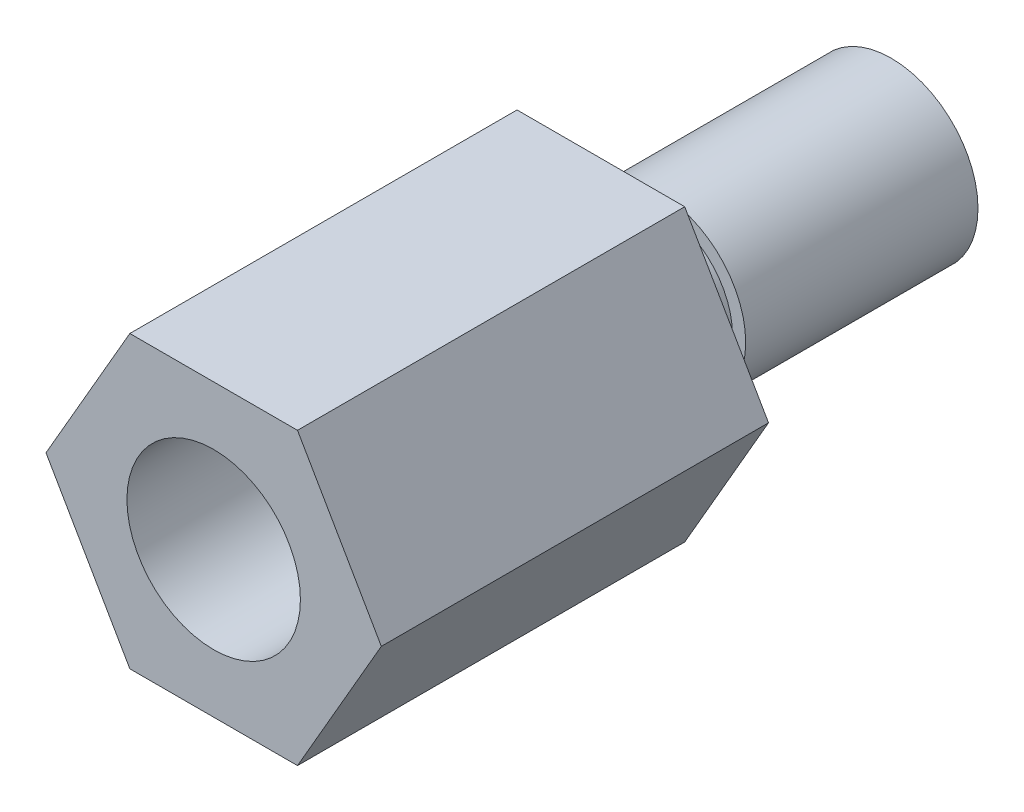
ISO-10303-21;
HEADER;
FILE_DESCRIPTION(('STEP AP214'),'2;1');
FILE_NAME('part.step','',(''),(''),'','','');
FILE_SCHEMA(('AUTOMOTIVE_DESIGN { 1 0 10303 214 1 1 1 1 }'));
ENDSEC;
DATA;
#1=APPLICATION_CONTEXT('core data for automotive mechanical design processes');
#2=APPLICATION_PROTOCOL_DEFINITION('international standard','automotive_design',2000,#1);
#3=PRODUCT_CONTEXT('',#1,'mechanical');
#4=PRODUCT('Part','Part','',(#3));
#5=PRODUCT_RELATED_PRODUCT_CATEGORY('part','',(#4));
#6=PRODUCT_DEFINITION_FORMATION('','',#4);
#7=PRODUCT_DEFINITION_CONTEXT('part definition',#1,'design');
#8=PRODUCT_DEFINITION('design','',#6,#7);
#9=PRODUCT_DEFINITION_SHAPE('','',#8);
#10=(LENGTH_UNIT() NAMED_UNIT(*) SI_UNIT(.MILLI.,.METRE.));
#11=(NAMED_UNIT(*) PLANE_ANGLE_UNIT() SI_UNIT($,.RADIAN.));
#12=(NAMED_UNIT(*) SI_UNIT($,.STERADIAN.) SOLID_ANGLE_UNIT());
#13=UNCERTAINTY_MEASURE_WITH_UNIT(LENGTH_MEASURE(1.E-05),#10,'distance_accuracy_value','');
#14=(GEOMETRIC_REPRESENTATION_CONTEXT(3) GLOBAL_UNCERTAINTY_ASSIGNED_CONTEXT((#13)) GLOBAL_UNIT_ASSIGNED_CONTEXT((#10,
#11,#12)) REPRESENTATION_CONTEXT('',''));
#15=CARTESIAN_POINT('',(0.,0.,0.));
#16=DIRECTION('',(0.,0.,1.));
#17=DIRECTION('',(1.,0.,0.));
#18=AXIS2_PLACEMENT_3D('',#15,#16,#17);
#19=CARTESIAN_POINT('',(-4.12444598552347,-2.38125000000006,0.));
#20=DIRECTION('',(0.,0.,1.));
#21=DIRECTION('',(1.,0.,0.));
#22=AXIS2_PLACEMENT_3D('',#19,#20,#21);
#23=PLANE('',#22);
#24=DIRECTION('',(-0.499999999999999,-0.866025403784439,0.));
#25=VECTOR('',#24,1.);
#26=CARTESIAN_POINT('',(-2.74963065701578,0.,0.));
#27=LINE('',#26,#25);
#28=CARTESIAN_POINT('',(-1.37481532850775,2.38124999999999,0.));
#29=VERTEX_POINT('',#28);
#30=CARTESIAN_POINT('',(-2.74963065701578,0.,0.));
#31=VERTEX_POINT('',#30);
#32=EDGE_CURVE('E83',#29,#31,#27,.T.);
#33=ORIENTED_EDGE('',*,*,#32,.F.);
#34=DIRECTION('',(-1.,0.,0.));
#35=VECTOR('',#34,1.);
#36=CARTESIAN_POINT('',(-1.37481532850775,2.38124999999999,0.));
#37=LINE('',#36,#35);
#38=CARTESIAN_POINT('',(1.37481532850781,2.38125,0.));
#39=VERTEX_POINT('',#38);
#40=EDGE_CURVE('E109',#39,#29,#37,.T.);
#41=ORIENTED_EDGE('',*,*,#40,.F.);
#42=DIRECTION('',(-0.499999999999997,0.86602540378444,0.));
#43=VECTOR('',#42,1.);
#44=CARTESIAN_POINT('',(1.37481532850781,2.38125,0.));
#45=LINE('',#44,#43);
#46=CARTESIAN_POINT('',(2.74963065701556,0.,0.));
#47=VERTEX_POINT('',#46);
#48=EDGE_CURVE('E107',#47,#39,#45,.T.);
#49=ORIENTED_EDGE('',*,*,#48,.F.);
#50=DIRECTION('',(0.499999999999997,0.86602540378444,0.));
#51=VECTOR('',#50,1.);
#52=CARTESIAN_POINT('',(2.74963065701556,0.,0.));
#53=LINE('',#52,#51);
#54=CARTESIAN_POINT('',(1.37481532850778,-2.38125000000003,0.));
#55=VERTEX_POINT('',#54);
#56=EDGE_CURVE('E105',#55,#47,#53,.T.);
#57=ORIENTED_EDGE('',*,*,#56,.F.);
#58=DIRECTION('',(1.,0.,0.));
#59=VECTOR('',#58,1.);
#60=CARTESIAN_POINT('',(1.37481532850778,-2.38125000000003,0.));
#61=LINE('',#60,#59);
#62=CARTESIAN_POINT('',(-1.37481532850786,-2.38125000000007,0.));
#63=VERTEX_POINT('',#62);
#64=EDGE_CURVE('E85',#63,#55,#61,.T.);
#65=ORIENTED_EDGE('',*,*,#64,.F.);
#66=DIRECTION('',(0.499999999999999,-0.86602540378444,0.));
#67=VECTOR('',#66,1.);
#68=CARTESIAN_POINT('',(-1.37481532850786,-2.38125000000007,0.));
#69=LINE('',#68,#67);
#70=EDGE_CURVE('E79',#31,#63,#69,.T.);
#71=ORIENTED_EDGE('',*,*,#70,.F.);
#72=EDGE_LOOP('',(#33,#41,#49,#57,#65,#71));
#73=FACE_BOUND('',#72,.T.);
#74=CARTESIAN_POINT('',(0.,0.,0.));
#75=DIRECTION('',(0.,0.,-1.));
#76=DIRECTION('',(-1.,0.,0.));
#77=AXIS2_PLACEMENT_3D('',#74,#75,#76);
#78=CIRCLE('',#77,1.2065);
#79=CARTESIAN_POINT('',(1.2065,0.,0.));
#80=VERTEX_POINT('',#79);
#81=EDGE_CURVE('E189',#80,#80,#78,.T.);
#82=ORIENTED_EDGE('',*,*,#81,.F.);
#83=EDGE_LOOP('',(#82));
#84=FACE_BOUND('',#83,.T.);
#85=ADVANCED_FACE('F26',(#73,#84),#23,.F.);
#86=CARTESIAN_POINT('',(-2.74963065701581,0.,6.35));
#87=DIRECTION('',(0.866025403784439,-0.499999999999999,0.));
#88=DIRECTION('',(0.499999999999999,0.86602540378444,0.));
#89=AXIS2_PLACEMENT_3D('',#86,#87,#88);
#90=PLANE('',#89);
#91=ORIENTED_EDGE('',*,*,#32,.T.);
#92=DIRECTION('',(0.,0.,-1.));
#93=VECTOR('',#92,1.);
#94=CARTESIAN_POINT('',(-2.74963065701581,0.,6.35));
#95=LINE('',#94,#93);
#96=CARTESIAN_POINT('',(-2.74963065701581,0.,6.35));
#97=VERTEX_POINT('',#96);
#98=EDGE_CURVE('E11',#97,#31,#95,.T.);
#99=ORIENTED_EDGE('',*,*,#98,.F.);
#100=DIRECTION('',(-0.499999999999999,-0.866025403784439,0.));
#101=VECTOR('',#100,1.);
#102=CARTESIAN_POINT('',(-2.74963065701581,0.,6.35));
#103=LINE('',#102,#101);
#104=CARTESIAN_POINT('',(-1.37481532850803,2.38125000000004,6.35));
#105=VERTEX_POINT('',#104);
#106=EDGE_CURVE('E111',#105,#97,#103,.T.);
#107=ORIENTED_EDGE('',*,*,#106,.F.);
#108=DIRECTION('',(0.,0.,-1.));
#109=VECTOR('',#108,1.);
#110=CARTESIAN_POINT('',(-1.37481532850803,2.38125000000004,6.35));
#111=LINE('',#110,#109);
#112=EDGE_CURVE('E96',#105,#29,#111,.T.);
#113=ORIENTED_EDGE('',*,*,#112,.T.);
#114=EDGE_LOOP('',(#91,#99,#107,#113));
#115=FACE_BOUND('',#114,.T.);
#116=ADVANCED_FACE('F28',(#115),#90,.F.);
#117=CARTESIAN_POINT('',(-1.37481532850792,-2.38125000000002,6.35));
#118=DIRECTION('',(0.866025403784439,0.499999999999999,0.));
#119=DIRECTION('',(-0.499999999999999,0.86602540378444,0.));
#120=AXIS2_PLACEMENT_3D('',#117,#118,#119);
#121=PLANE('',#120);
#122=ORIENTED_EDGE('',*,*,#70,.T.);
#123=DIRECTION('',(0.,0.,-1.));
#124=VECTOR('',#123,1.);
#125=CARTESIAN_POINT('',(-1.37481532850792,-2.38125000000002,6.35));
#126=LINE('',#125,#124);
#127=CARTESIAN_POINT('',(-1.37481532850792,-2.38125000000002,6.35));
#128=VERTEX_POINT('',#127);
#129=EDGE_CURVE('E34',#128,#63,#126,.T.);
#130=ORIENTED_EDGE('',*,*,#129,.F.);
#131=DIRECTION('',(0.499999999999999,-0.86602540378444,0.));
#132=VECTOR('',#131,1.);
#133=CARTESIAN_POINT('',(-1.37481532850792,-2.38125000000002,6.35));
#134=LINE('',#133,#132);
#135=EDGE_CURVE('E92',#97,#128,#134,.T.);
#136=ORIENTED_EDGE('',*,*,#135,.F.);
#137=ORIENTED_EDGE('',*,*,#98,.T.);
#138=EDGE_LOOP('',(#122,#130,#136,#137));
#139=FACE_BOUND('',#138,.T.);
#140=ADVANCED_FACE('F91',(#139),#121,.F.);
#141=CARTESIAN_POINT('',(1.37481532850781,-2.38125,6.35));
#142=DIRECTION('',(0.,1.,0.));
#143=DIRECTION('',(-1.,0.,0.));
#144=AXIS2_PLACEMENT_3D('',#141,#142,#143);
#145=PLANE('',#144);
#146=ORIENTED_EDGE('',*,*,#64,.T.);
#147=DIRECTION('',(0.,0.,-1.));
#148=VECTOR('',#147,1.);
#149=CARTESIAN_POINT('',(1.37481532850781,-2.38125,6.35));
#150=LINE('',#149,#148);
#151=CARTESIAN_POINT('',(1.37481532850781,-2.38125,6.35));
#152=VERTEX_POINT('',#151);
#153=EDGE_CURVE('E127',#152,#55,#150,.T.);
#154=ORIENTED_EDGE('',*,*,#153,.F.);
#155=DIRECTION('',(1.,0.,0.));
#156=VECTOR('',#155,1.);
#157=CARTESIAN_POINT('',(1.37481532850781,-2.38125,6.35));
#158=LINE('',#157,#156);
#159=EDGE_CURVE('E114',#128,#152,#158,.T.);
#160=ORIENTED_EDGE('',*,*,#159,.F.);
#161=ORIENTED_EDGE('',*,*,#129,.T.);
#162=EDGE_LOOP('',(#146,#154,#160,#161));
#163=FACE_BOUND('',#162,.T.);
#164=ADVANCED_FACE('F131',(#163),#145,.F.);
#165=CARTESIAN_POINT('',(2.74963065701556,0.,6.34999999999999));
#166=DIRECTION('',(-0.86602540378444,0.499999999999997,0.));
#167=DIRECTION('',(-0.499999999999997,-0.86602540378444,0.));
#168=AXIS2_PLACEMENT_3D('',#165,#166,#167);
#169=PLANE('',#168);
#170=ORIENTED_EDGE('',*,*,#56,.T.);
#171=DIRECTION('',(0.,0.,-1.));
#172=VECTOR('',#171,1.);
#173=CARTESIAN_POINT('',(2.74963065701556,0.,6.34999999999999));
#174=LINE('',#173,#172);
#175=CARTESIAN_POINT('',(2.74963065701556,0.,6.34999999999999));
#176=VERTEX_POINT('',#175);
#177=EDGE_CURVE('E124',#176,#47,#174,.T.);
#178=ORIENTED_EDGE('',*,*,#177,.F.);
#179=DIRECTION('',(0.499999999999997,0.86602540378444,0.));
#180=VECTOR('',#179,1.);
#181=CARTESIAN_POINT('',(2.74963065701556,0.,6.34999999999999));
#182=LINE('',#181,#180);
#183=EDGE_CURVE('E116',#152,#176,#182,.T.);
#184=ORIENTED_EDGE('',*,*,#183,.F.);
#185=ORIENTED_EDGE('',*,*,#153,.T.);
#186=EDGE_LOOP('',(#170,#178,#184,#185));
#187=FACE_BOUND('',#186,.T.);
#188=ADVANCED_FACE('F137',(#187),#169,.F.);
#189=CARTESIAN_POINT('',(1.37481532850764,2.38125000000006,6.35));
#190=DIRECTION('',(-0.86602540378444,-0.499999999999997,0.));
#191=DIRECTION('',(0.499999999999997,-0.86602540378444,0.));
#192=AXIS2_PLACEMENT_3D('',#189,#190,#191);
#193=PLANE('',#192);
#194=ORIENTED_EDGE('',*,*,#48,.T.);
#195=DIRECTION('',(0.,0.,-1.));
#196=VECTOR('',#195,1.);
#197=CARTESIAN_POINT('',(1.37481532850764,2.38125000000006,6.35));
#198=LINE('',#197,#196);
#199=CARTESIAN_POINT('',(1.37481532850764,2.38125000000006,6.35));
#200=VERTEX_POINT('',#199);
#201=EDGE_CURVE('E121',#200,#39,#198,.T.);
#202=ORIENTED_EDGE('',*,*,#201,.F.);
#203=DIRECTION('',(-0.499999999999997,0.86602540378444,0.));
#204=VECTOR('',#203,1.);
#205=CARTESIAN_POINT('',(1.37481532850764,2.38125000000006,6.35));
#206=LINE('',#205,#204);
#207=EDGE_CURVE('E46',#176,#200,#206,.T.);
#208=ORIENTED_EDGE('',*,*,#207,.F.);
#209=ORIENTED_EDGE('',*,*,#177,.T.);
#210=EDGE_LOOP('',(#194,#202,#208,#209));
#211=FACE_BOUND('',#210,.T.);
#212=ADVANCED_FACE('F140',(#211),#193,.F.);
#213=CARTESIAN_POINT('',(-1.37481532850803,2.38125000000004,6.35));
#214=DIRECTION('',(0.,-1.,0.));
#215=DIRECTION('',(0.,0.,-1.));
#216=AXIS2_PLACEMENT_3D('',#213,#214,#215);
#217=PLANE('',#216);
#218=ORIENTED_EDGE('',*,*,#40,.T.);
#219=ORIENTED_EDGE('',*,*,#112,.F.);
#220=DIRECTION('',(-1.,0.,0.));
#221=VECTOR('',#220,1.);
#222=CARTESIAN_POINT('',(-1.37481532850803,2.38125000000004,6.35));
#223=LINE('',#222,#221);
#224=EDGE_CURVE('E41',#200,#105,#223,.T.);
#225=ORIENTED_EDGE('',*,*,#224,.F.);
#226=ORIENTED_EDGE('',*,*,#201,.T.);
#227=EDGE_LOOP('',(#218,#219,#225,#226));
#228=FACE_BOUND('',#227,.T.);
#229=ADVANCED_FACE('F142',(#228),#217,.F.);
#230=CARTESIAN_POINT('',(-4.12444598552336,-2.38125000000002,6.35));
#231=DIRECTION('',(0.,0.,1.));
#232=DIRECTION('',(1.,0.,0.));
#233=AXIS2_PLACEMENT_3D('',#230,#231,#232);
#234=PLANE('',#233);
#235=CARTESIAN_POINT('',(-1.38777878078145E-13,0.,6.34999999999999));
#236=DIRECTION('',(0.,0.,1.));
#237=DIRECTION('',(1.,0.,0.));
#238=AXIS2_PLACEMENT_3D('',#235,#236,#237);
#239=CIRCLE('',#238,1.4224);
#240=CARTESIAN_POINT('',(1.4224,0.,6.34999999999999));
#241=VERTEX_POINT('',#240);
#242=EDGE_CURVE('E196',#241,#241,#239,.T.);
#243=ORIENTED_EDGE('',*,*,#242,.F.);
#244=EDGE_LOOP('',(#243));
#245=FACE_BOUND('',#244,.T.);
#246=ORIENTED_EDGE('',*,*,#106,.T.);
#247=ORIENTED_EDGE('',*,*,#135,.T.);
#248=ORIENTED_EDGE('',*,*,#159,.T.);
#249=ORIENTED_EDGE('',*,*,#183,.T.);
#250=ORIENTED_EDGE('',*,*,#207,.T.);
#251=ORIENTED_EDGE('',*,*,#224,.T.);
#252=EDGE_LOOP('',(#246,#247,#248,#249,#250,#251));
#253=FACE_BOUND('',#252,.T.);
#254=ADVANCED_FACE('F134',(#245,#253),#234,.T.);
#255=CARTESIAN_POINT('',(0.,0.,2.38124999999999));
#256=DIRECTION('',(0.,0.,1.));
#257=DIRECTION('',(1.,0.,0.));
#258=AXIS2_PLACEMENT_3D('',#255,#256,#257);
#259=CYLINDRICAL_SURFACE('',#258,1.4224);
#260=CARTESIAN_POINT('',(0.,0.,2.38124999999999));
#261=DIRECTION('',(0.,0.,1.));
#262=DIRECTION('',(1.,0.,0.));
#263=AXIS2_PLACEMENT_3D('',#260,#261,#262);
#264=CIRCLE('',#263,1.4224);
#265=CARTESIAN_POINT('',(1.4224,0.,2.38124999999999));
#266=VERTEX_POINT('',#265);
#267=EDGE_CURVE('E100',#266,#266,#264,.T.);
#268=CARTESIAN_POINT('',(1.4224,0.,2.38124999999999));
#269=CARTESIAN_POINT('',(1.4224,0.,2.42259114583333));
#270=CARTESIAN_POINT('',(1.4224,0.,2.46393229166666));
#271=CARTESIAN_POINT('',(1.4224,0.,2.54661458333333));
#272=CARTESIAN_POINT('',(1.4224,0.,2.58795572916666));
#273=CARTESIAN_POINT('',(1.4224,0.,2.67063802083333));
#274=CARTESIAN_POINT('',(1.4224,0.,2.71197916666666));
#275=CARTESIAN_POINT('',(1.4224,0.,2.79466145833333));
#276=CARTESIAN_POINT('',(1.4224,0.,2.83600260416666));
#277=CARTESIAN_POINT('',(1.4224,0.,2.91868489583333));
#278=CARTESIAN_POINT('',(1.4224,0.,2.96002604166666));
#279=CARTESIAN_POINT('',(1.4224,0.,3.04270833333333));
#280=CARTESIAN_POINT('',(1.4224,0.,3.08404947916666));
#281=CARTESIAN_POINT('',(1.4224,0.,3.16673177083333));
#282=CARTESIAN_POINT('',(1.4224,0.,3.20807291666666));
#283=CARTESIAN_POINT('',(1.4224,0.,3.29075520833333));
#284=CARTESIAN_POINT('',(1.4224,0.,3.33209635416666));
#285=CARTESIAN_POINT('',(1.4224,0.,3.41477864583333));
#286=CARTESIAN_POINT('',(1.4224,0.,3.45611979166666));
#287=CARTESIAN_POINT('',(1.4224,0.,3.53880208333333));
#288=CARTESIAN_POINT('',(1.4224,0.,3.58014322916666));
#289=CARTESIAN_POINT('',(1.4224,0.,3.66282552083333));
#290=CARTESIAN_POINT('',(1.4224,0.,3.70416666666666));
#291=CARTESIAN_POINT('',(1.4224,0.,3.78684895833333));
#292=CARTESIAN_POINT('',(1.4224,0.,3.82819010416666));
#293=CARTESIAN_POINT('',(1.4224,0.,3.91087239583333));
#294=CARTESIAN_POINT('',(1.4224,0.,3.95221354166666));
#295=CARTESIAN_POINT('',(1.4224,0.,4.03489583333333));
#296=CARTESIAN_POINT('',(1.4224,0.,4.07623697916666));
#297=CARTESIAN_POINT('',(1.4224,0.,4.15891927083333));
#298=CARTESIAN_POINT('',(1.4224,0.,4.20026041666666));
#299=CARTESIAN_POINT('',(1.4224,0.,4.28294270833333));
#300=CARTESIAN_POINT('',(1.4224,0.,4.32428385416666));
#301=CARTESIAN_POINT('',(1.4224,0.,4.40696614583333));
#302=CARTESIAN_POINT('',(1.4224,0.,4.44830729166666));
#303=CARTESIAN_POINT('',(1.4224,0.,4.53098958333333));
#304=CARTESIAN_POINT('',(1.4224,0.,4.57233072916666));
#305=CARTESIAN_POINT('',(1.4224,0.,4.65501302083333));
#306=CARTESIAN_POINT('',(1.4224,0.,4.69635416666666));
#307=CARTESIAN_POINT('',(1.4224,0.,4.77903645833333));
#308=CARTESIAN_POINT('',(1.4224,0.,4.82037760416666));
#309=CARTESIAN_POINT('',(1.4224,0.,4.90305989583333));
#310=CARTESIAN_POINT('',(1.4224,0.,4.94440104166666));
#311=CARTESIAN_POINT('',(1.4224,0.,5.02708333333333));
#312=CARTESIAN_POINT('',(1.4224,0.,5.06842447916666));
#313=CARTESIAN_POINT('',(1.4224,0.,5.15110677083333));
#314=CARTESIAN_POINT('',(1.4224,0.,5.19244791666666));
#315=CARTESIAN_POINT('',(1.4224,0.,5.27513020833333));
#316=CARTESIAN_POINT('',(1.4224,0.,5.31647135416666));
#317=CARTESIAN_POINT('',(1.4224,0.,5.39915364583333));
#318=CARTESIAN_POINT('',(1.4224,0.,5.44049479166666));
#319=CARTESIAN_POINT('',(1.4224,0.,5.52317708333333));
#320=CARTESIAN_POINT('',(1.4224,0.,5.56451822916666));
#321=CARTESIAN_POINT('',(1.4224,0.,5.64720052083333));
#322=CARTESIAN_POINT('',(1.4224,0.,5.68854166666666));
#323=CARTESIAN_POINT('',(1.4224,0.,5.77122395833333));
#324=CARTESIAN_POINT('',(1.4224,0.,5.81256510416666));
#325=CARTESIAN_POINT('',(1.4224,0.,5.89524739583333));
#326=CARTESIAN_POINT('',(1.4224,0.,5.93658854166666));
#327=CARTESIAN_POINT('',(1.4224,0.,6.01927083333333));
#328=CARTESIAN_POINT('',(1.4224,0.,6.06061197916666));
#329=CARTESIAN_POINT('',(1.4224,0.,6.14329427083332));
#330=CARTESIAN_POINT('',(1.4224,0.,6.18463541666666));
#331=CARTESIAN_POINT('',(1.4224,0.,6.26731770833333));
#332=CARTESIAN_POINT('',(1.4224,0.,6.30865885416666));
#333=CARTESIAN_POINT('',(1.4224,0.,6.34999999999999));
#334=B_SPLINE_CURVE_WITH_KNOTS('',3,(#268,#269,#270,#271,#272,#273,#274,#275,#276,#277,#278,
#279,#280,#281,#282,#283,#284,#285,#286,#287,#288,#289,#290,#291,#292,#293,#294,#295,#296,#297,
#298,#299,#300,#301,#302,#303,#304,#305,#306,#307,#308,#309,#310,#311,#312,#313,#314,#315,#316,
#317,#318,#319,#320,#321,#322,#323,#324,#325,#326,#327,#328,#329,#330,#331,#332,#333),
.UNSPECIFIED.,.F.,.F.,(4,2,2,2,2,2,2,2,2,2,2,2,2,2,2,2,2,2,2,2,2,2,2,2,2,2,2,2,2,2,2,2,4),(0.,
0.1240234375,0.248046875,0.3720703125,0.49609375,0.620117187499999,0.744140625,
0.868164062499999,0.992187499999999,1.1162109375,1.240234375,1.3642578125,1.48828125,
1.6123046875,1.736328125,1.8603515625,1.984375,2.1083984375,2.232421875,2.3564453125,2.48046875,
2.6044921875,2.728515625,2.8525390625,2.9765625,3.1005859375,3.224609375,3.3486328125,
3.47265625,3.5966796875,3.720703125,3.8447265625,3.96875),.UNSPECIFIED.);
#335=EDGE_CURVE('BSEAM149',#266,#241,#334,.T.);
#336=ORIENTED_EDGE('',*,*,#267,.F.);
#337=ORIENTED_EDGE('',*,*,#242,.T.);
#338=ORIENTED_EDGE('',*,*,#335,.T.);
#339=ORIENTED_EDGE('',*,*,#335,.F.);
#340=EDGE_LOOP('',(#336,#338,#337,#339));
#341=FACE_BOUND('',#340,.T.);
#342=ADVANCED_FACE('F149',(#341),#259,.F.);
#343=CARTESIAN_POINT('',(0.,0.,2.38124999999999));
#344=DIRECTION('',(0.,0.,1.));
#345=DIRECTION('',(1.,0.,0.));
#346=AXIS2_PLACEMENT_3D('',#343,#344,#345);
#347=PLANE('',#346);
#348=ORIENTED_EDGE('',*,*,#267,.T.);
#349=EDGE_LOOP('',(#348));
#350=FACE_BOUND('',#349,.T.);
#351=ADVANCED_FACE('F170',(#350),#347,.T.);
#352=CARTESIAN_POINT('',(0.,0.,-0.952500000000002));
#353=DIRECTION('',(0.,0.,-1.));
#354=DIRECTION('',(-1.,0.,0.));
#355=AXIS2_PLACEMENT_3D('',#352,#353,#354);
#356=PLANE('',#355);
#357=CARTESIAN_POINT('',(0.,0.,-0.952500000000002));
#358=DIRECTION('',(0.,0.,-1.));
#359=DIRECTION('',(-1.,0.,0.));
#360=AXIS2_PLACEMENT_3D('',#357,#358,#359);
#361=CIRCLE('',#360,1.4224);
#362=CARTESIAN_POINT('',(1.4224,0.,-0.952500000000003));
#363=VERTEX_POINT('',#362);
#364=EDGE_CURVE('E191',#363,#363,#361,.T.);
#365=ORIENTED_EDGE('',*,*,#364,.F.);
#366=EDGE_LOOP('',(#365));
#367=FACE_BOUND('',#366,.T.);
#368=CARTESIAN_POINT('',(0.,0.,-0.952500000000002));
#369=DIRECTION('',(0.,0.,-1.));
#370=DIRECTION('',(-1.,0.,0.));
#371=AXIS2_PLACEMENT_3D('',#368,#369,#370);
#372=CIRCLE('',#371,1.2065);
#373=CARTESIAN_POINT('',(1.2065,0.,-0.952500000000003));
#374=VERTEX_POINT('',#373);
#375=EDGE_CURVE('E186',#374,#374,#372,.T.);
#376=ORIENTED_EDGE('',*,*,#375,.T.);
#377=EDGE_LOOP('',(#376));
#378=FACE_BOUND('',#377,.T.);
#379=ADVANCED_FACE('F174',(#367,#378),#356,.F.);
#380=CARTESIAN_POINT('',(0.,0.,-0.952500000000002));
#381=DIRECTION('',(0.,0.,0.999999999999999));
#382=DIRECTION('',(1.,0.,0.));
#383=AXIS2_PLACEMENT_3D('',#380,#381,#382);
#384=CYLINDRICAL_SURFACE('',#383,1.2065);
#385=CARTESIAN_POINT('',(1.2065,0.,-0.952500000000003));
#386=CARTESIAN_POINT('',(1.2065,0.,-0.942578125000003));
#387=CARTESIAN_POINT('',(1.2065,0.,-0.932656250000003));
#388=CARTESIAN_POINT('',(1.2065,0.,-0.912812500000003));
#389=CARTESIAN_POINT('',(1.2065,0.,-0.902890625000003));
#390=CARTESIAN_POINT('',(1.2065,0.,-0.883046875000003));
#391=CARTESIAN_POINT('',(1.2065,0.,-0.873125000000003));
#392=CARTESIAN_POINT('',(1.2065,0.,-0.853281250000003));
#393=CARTESIAN_POINT('',(1.2065,0.,-0.843359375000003));
#394=CARTESIAN_POINT('',(1.2065,0.,-0.823515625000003));
#395=CARTESIAN_POINT('',(1.2065,0.,-0.813593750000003));
#396=CARTESIAN_POINT('',(1.2065,0.,-0.793750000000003));
#397=CARTESIAN_POINT('',(1.2065,0.,-0.783828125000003));
#398=CARTESIAN_POINT('',(1.2065,0.,-0.763984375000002));
#399=CARTESIAN_POINT('',(1.2065,0.,-0.754062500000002));
#400=CARTESIAN_POINT('',(1.2065,0.,-0.734218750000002));
#401=CARTESIAN_POINT('',(1.2065,0.,-0.724296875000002));
#402=CARTESIAN_POINT('',(1.2065,0.,-0.704453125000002));
#403=CARTESIAN_POINT('',(1.2065,0.,-0.694531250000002));
#404=CARTESIAN_POINT('',(1.2065,0.,-0.674687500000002));
#405=CARTESIAN_POINT('',(1.2065,0.,-0.664765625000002));
#406=CARTESIAN_POINT('',(1.2065,0.,-0.644921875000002));
#407=CARTESIAN_POINT('',(1.2065,0.,-0.635000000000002));
#408=CARTESIAN_POINT('',(1.2065,0.,-0.615156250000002));
#409=CARTESIAN_POINT('',(1.2065,0.,-0.605234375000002));
#410=CARTESIAN_POINT('',(1.2065,0.,-0.585390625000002));
#411=CARTESIAN_POINT('',(1.2065,0.,-0.575468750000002));
#412=CARTESIAN_POINT('',(1.2065,0.,-0.555625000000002));
#413=CARTESIAN_POINT('',(1.2065,0.,-0.545703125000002));
#414=CARTESIAN_POINT('',(1.2065,0.,-0.525859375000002));
#415=CARTESIAN_POINT('',(1.2065,0.,-0.515937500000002));
#416=CARTESIAN_POINT('',(1.2065,0.,-0.496093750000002));
#417=CARTESIAN_POINT('',(1.2065,0.,-0.486171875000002));
#418=CARTESIAN_POINT('',(1.2065,0.,-0.466328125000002));
#419=CARTESIAN_POINT('',(1.2065,0.,-0.456406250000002));
#420=CARTESIAN_POINT('',(1.2065,0.,-0.436562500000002));
#421=CARTESIAN_POINT('',(1.2065,0.,-0.426640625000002));
#422=CARTESIAN_POINT('',(1.2065,0.,-0.406796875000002));
#423=CARTESIAN_POINT('',(1.2065,0.,-0.396875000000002));
#424=CARTESIAN_POINT('',(1.2065,0.,-0.377031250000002));
#425=CARTESIAN_POINT('',(1.2065,0.,-0.367109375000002));
#426=CARTESIAN_POINT('',(1.2065,0.,-0.347265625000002));
#427=CARTESIAN_POINT('',(1.2065,0.,-0.337343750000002));
#428=CARTESIAN_POINT('',(1.2065,0.,-0.317500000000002));
#429=CARTESIAN_POINT('',(1.2065,0.,-0.307578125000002));
#430=CARTESIAN_POINT('',(1.2065,0.,-0.287734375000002));
#431=CARTESIAN_POINT('',(1.2065,0.,-0.277812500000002));
#432=CARTESIAN_POINT('',(1.2065,0.,-0.257968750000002));
#433=CARTESIAN_POINT('',(1.2065,0.,-0.248046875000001));
#434=CARTESIAN_POINT('',(1.2065,0.,-0.228203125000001));
#435=CARTESIAN_POINT('',(1.2065,0.,-0.218281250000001));
#436=CARTESIAN_POINT('',(1.2065,0.,-0.198437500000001));
#437=CARTESIAN_POINT('',(1.2065,0.,-0.188515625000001));
#438=CARTESIAN_POINT('',(1.2065,0.,-0.168671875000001));
#439=CARTESIAN_POINT('',(1.2065,0.,-0.158750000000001));
#440=CARTESIAN_POINT('',(1.2065,0.,-0.138906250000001));
#441=CARTESIAN_POINT('',(1.2065,0.,-0.128984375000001));
#442=CARTESIAN_POINT('',(1.2065,0.,-0.109140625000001));
#443=CARTESIAN_POINT('',(1.2065,0.,-0.0992187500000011));
#444=CARTESIAN_POINT('',(1.2065,0.,-0.0793750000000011));
#445=CARTESIAN_POINT('',(1.2065,0.,-0.0694531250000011));
#446=CARTESIAN_POINT('',(1.2065,0.,-0.0496093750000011));
#447=CARTESIAN_POINT('',(1.2065,0.,-0.0396875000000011));
#448=CARTESIAN_POINT('',(1.2065,0.,-0.019843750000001));
#449=CARTESIAN_POINT('',(1.2065,0.,-0.00992187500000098));
#450=CARTESIAN_POINT('',(1.2065,0.,0.));
#451=B_SPLINE_CURVE_WITH_KNOTS('',3,(#385,#386,#387,#388,#389,#390,#391,#392,#393,#394,#395,
#396,#397,#398,#399,#400,#401,#402,#403,#404,#405,#406,#407,#408,#409,#410,#411,#412,#413,#414,
#415,#416,#417,#418,#419,#420,#421,#422,#423,#424,#425,#426,#427,#428,#429,#430,#431,#432,#433,
#434,#435,#436,#437,#438,#439,#440,#441,#442,#443,#444,#445,#446,#447,#448,#449,#450),
.UNSPECIFIED.,.F.,.F.,(4,2,2,2,2,2,2,2,2,2,2,2,2,2,2,2,2,2,2,2,2,2,2,2,2,2,2,2,2,2,2,2,4),(0.,
0.0297656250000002,0.0595312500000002,0.0892968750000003,0.1190625,0.148828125,0.17859375,
0.208359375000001,0.238125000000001,0.267890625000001,0.297656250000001,0.327421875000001,
0.357187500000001,0.386953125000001,0.416718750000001,0.446484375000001,0.476250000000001,
0.506015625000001,0.535781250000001,0.565546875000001,0.595312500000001,0.625078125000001,
0.654843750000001,0.684609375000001,0.714375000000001,0.744140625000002,0.773906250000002,
0.803671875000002,0.833437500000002,0.863203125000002,0.892968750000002,0.922734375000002,
0.952500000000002),.UNSPECIFIED.);
#452=EDGE_CURVE('BSEAM166',#374,#80,#451,.T.);
#453=ORIENTED_EDGE('',*,*,#375,.F.);
#454=ORIENTED_EDGE('',*,*,#81,.T.);
#455=ORIENTED_EDGE('',*,*,#452,.T.);
#456=ORIENTED_EDGE('',*,*,#452,.F.);
#457=EDGE_LOOP('',(#453,#455,#454,#456));
#458=FACE_BOUND('',#457,.T.);
#459=ADVANCED_FACE('F166',(#458),#384,.T.);
#460=CARTESIAN_POINT('',(0.,0.,-4.7625));
#461=DIRECTION('',(0.,0.,-1.));
#462=DIRECTION('',(-1.,0.,0.));
#463=AXIS2_PLACEMENT_3D('',#460,#461,#462);
#464=PLANE('',#463);
#465=CARTESIAN_POINT('',(0.,0.,-4.7625));
#466=DIRECTION('',(0.,0.,-1.));
#467=DIRECTION('',(-1.,0.,0.));
#468=AXIS2_PLACEMENT_3D('',#465,#466,#467);
#469=CIRCLE('',#468,1.4224);
#470=CARTESIAN_POINT('',(1.4224,0.,-4.7625));
#471=VERTEX_POINT('',#470);
#472=EDGE_CURVE('E97',#471,#471,#469,.T.);
#473=ORIENTED_EDGE('',*,*,#472,.T.);
#474=EDGE_LOOP('',(#473));
#475=FACE_BOUND('',#474,.T.);
#476=ADVANCED_FACE('F162',(#475),#464,.T.);
#477=CARTESIAN_POINT('',(0.,0.,-4.7625));
#478=DIRECTION('',(0.,0.,0.999999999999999));
#479=DIRECTION('',(1.,0.,0.));
#480=AXIS2_PLACEMENT_3D('',#477,#478,#479);
#481=CYLINDRICAL_SURFACE('',#480,1.4224);
#482=CARTESIAN_POINT('',(1.4224,0.,-0.952500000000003));
#483=CARTESIAN_POINT('',(1.4224,0.,-0.992187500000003));
#484=CARTESIAN_POINT('',(1.4224,0.,-1.031875));
#485=CARTESIAN_POINT('',(1.4224,0.,-1.11125));
#486=CARTESIAN_POINT('',(1.4224,0.,-1.1509375));
#487=CARTESIAN_POINT('',(1.4224,0.,-1.2303125));
#488=CARTESIAN_POINT('',(1.4224,0.,-1.27));
#489=CARTESIAN_POINT('',(1.4224,0.,-1.349375));
#490=CARTESIAN_POINT('',(1.4224,0.,-1.3890625));
#491=CARTESIAN_POINT('',(1.4224,0.,-1.4684375));
#492=CARTESIAN_POINT('',(1.4224,0.,-1.508125));
#493=CARTESIAN_POINT('',(1.4224,0.,-1.5875));
#494=CARTESIAN_POINT('',(1.4224,0.,-1.6271875));
#495=CARTESIAN_POINT('',(1.4224,0.,-1.7065625));
#496=CARTESIAN_POINT('',(1.4224,0.,-1.74625));
#497=CARTESIAN_POINT('',(1.4224,0.,-1.825625));
#498=CARTESIAN_POINT('',(1.4224,0.,-1.8653125));
#499=CARTESIAN_POINT('',(1.4224,0.,-1.9446875));
#500=CARTESIAN_POINT('',(1.4224,0.,-1.984375));
#501=CARTESIAN_POINT('',(1.4224,0.,-2.06375));
#502=CARTESIAN_POINT('',(1.4224,0.,-2.1034375));
#503=CARTESIAN_POINT('',(1.4224,0.,-2.1828125));
#504=CARTESIAN_POINT('',(1.4224,0.,-2.2225));
#505=CARTESIAN_POINT('',(1.4224,0.,-2.301875));
#506=CARTESIAN_POINT('',(1.4224,0.,-2.3415625));
#507=CARTESIAN_POINT('',(1.4224,0.,-2.4209375));
#508=CARTESIAN_POINT('',(1.4224,0.,-2.460625));
#509=CARTESIAN_POINT('',(1.4224,0.,-2.54));
#510=CARTESIAN_POINT('',(1.4224,0.,-2.5796875));
#511=CARTESIAN_POINT('',(1.4224,0.,-2.6590625));
#512=CARTESIAN_POINT('',(1.4224,0.,-2.69875));
#513=CARTESIAN_POINT('',(1.4224,0.,-2.778125));
#514=CARTESIAN_POINT('',(1.4224,0.,-2.8178125));
#515=CARTESIAN_POINT('',(1.4224,0.,-2.8971875));
#516=CARTESIAN_POINT('',(1.4224,0.,-2.936875));
#517=CARTESIAN_POINT('',(1.4224,0.,-3.01625));
#518=CARTESIAN_POINT('',(1.4224,0.,-3.0559375));
#519=CARTESIAN_POINT('',(1.4224,0.,-3.1353125));
#520=CARTESIAN_POINT('',(1.4224,0.,-3.175));
#521=CARTESIAN_POINT('',(1.4224,0.,-3.254375));
#522=CARTESIAN_POINT('',(1.4224,0.,-3.2940625));
#523=CARTESIAN_POINT('',(1.4224,0.,-3.3734375));
#524=CARTESIAN_POINT('',(1.4224,0.,-3.413125));
#525=CARTESIAN_POINT('',(1.4224,0.,-3.4925));
#526=CARTESIAN_POINT('',(1.4224,0.,-3.5321875));
#527=CARTESIAN_POINT('',(1.4224,0.,-3.6115625));
#528=CARTESIAN_POINT('',(1.4224,0.,-3.65125));
#529=CARTESIAN_POINT('',(1.4224,0.,-3.730625));
#530=CARTESIAN_POINT('',(1.4224,0.,-3.7703125));
#531=CARTESIAN_POINT('',(1.4224,0.,-3.8496875));
#532=CARTESIAN_POINT('',(1.4224,0.,-3.889375));
#533=CARTESIAN_POINT('',(1.4224,0.,-3.96875));
#534=CARTESIAN_POINT('',(1.4224,0.,-4.0084375));
#535=CARTESIAN_POINT('',(1.4224,0.,-4.0878125));
#536=CARTESIAN_POINT('',(1.4224,0.,-4.1275));
#537=CARTESIAN_POINT('',(1.4224,0.,-4.206875));
#538=CARTESIAN_POINT('',(1.4224,0.,-4.2465625));
#539=CARTESIAN_POINT('',(1.4224,0.,-4.3259375));
#540=CARTESIAN_POINT('',(1.4224,0.,-4.365625));
#541=CARTESIAN_POINT('',(1.4224,0.,-4.445));
#542=CARTESIAN_POINT('',(1.4224,0.,-4.4846875));
#543=CARTESIAN_POINT('',(1.4224,0.,-4.5640625));
#544=CARTESIAN_POINT('',(1.4224,0.,-4.60375));
#545=CARTESIAN_POINT('',(1.4224,0.,-4.683125));
#546=CARTESIAN_POINT('',(1.4224,0.,-4.7228125));
#547=CARTESIAN_POINT('',(1.4224,0.,-4.7625));
#548=B_SPLINE_CURVE_WITH_KNOTS('',3,(#482,#483,#484,#485,#486,#487,#488,#489,#490,#491,#492,
#493,#494,#495,#496,#497,#498,#499,#500,#501,#502,#503,#504,#505,#506,#507,#508,#509,#510,#511,
#512,#513,#514,#515,#516,#517,#518,#519,#520,#521,#522,#523,#524,#525,#526,#527,#528,#529,#530,
#531,#532,#533,#534,#535,#536,#537,#538,#539,#540,#541,#542,#543,#544,#545,#546,#547),
.UNSPECIFIED.,.F.,.F.,(4,2,2,2,2,2,2,2,2,2,2,2,2,2,2,2,2,2,2,2,2,2,2,2,2,2,2,2,2,2,2,2,4),(0.,
0.1190625,0.238125,0.357187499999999,0.47625,0.595312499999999,0.714374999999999,
0.833437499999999,0.952499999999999,1.0715625,1.190625,1.3096875,1.42875,1.5478125,1.666875,
1.7859375,1.905,2.0240625,2.143125,2.2621875,2.38125,2.5003125,2.619375,2.7384375,2.8575,
2.9765625,3.095625,3.2146875,3.33375,3.4528125,3.571875,3.6909375,3.81),.UNSPECIFIED.);
#549=EDGE_CURVE('BSEAM159',#363,#471,#548,.T.);
#550=ORIENTED_EDGE('',*,*,#364,.T.);
#551=ORIENTED_EDGE('',*,*,#472,.F.);
#552=ORIENTED_EDGE('',*,*,#549,.T.);
#553=ORIENTED_EDGE('',*,*,#549,.F.);
#554=EDGE_LOOP('',(#550,#552,#551,#553));
#555=FACE_BOUND('',#554,.T.);
#556=ADVANCED_FACE('F159',(#555),#481,.T.);
#557=CLOSED_SHELL('',(#85,#116,#140,#164,#188,#212,#229,#254,#342,#351,#379,#459,#476,#556));
#558=MANIFOLD_SOLID_BREP('B2',#557);
#559=ADVANCED_BREP_SHAPE_REPRESENTATION('',(#18,#558),#14);
#560=SHAPE_DEFINITION_REPRESENTATION(#9,#559);
ENDSEC;
END-ISO-10303-21;
